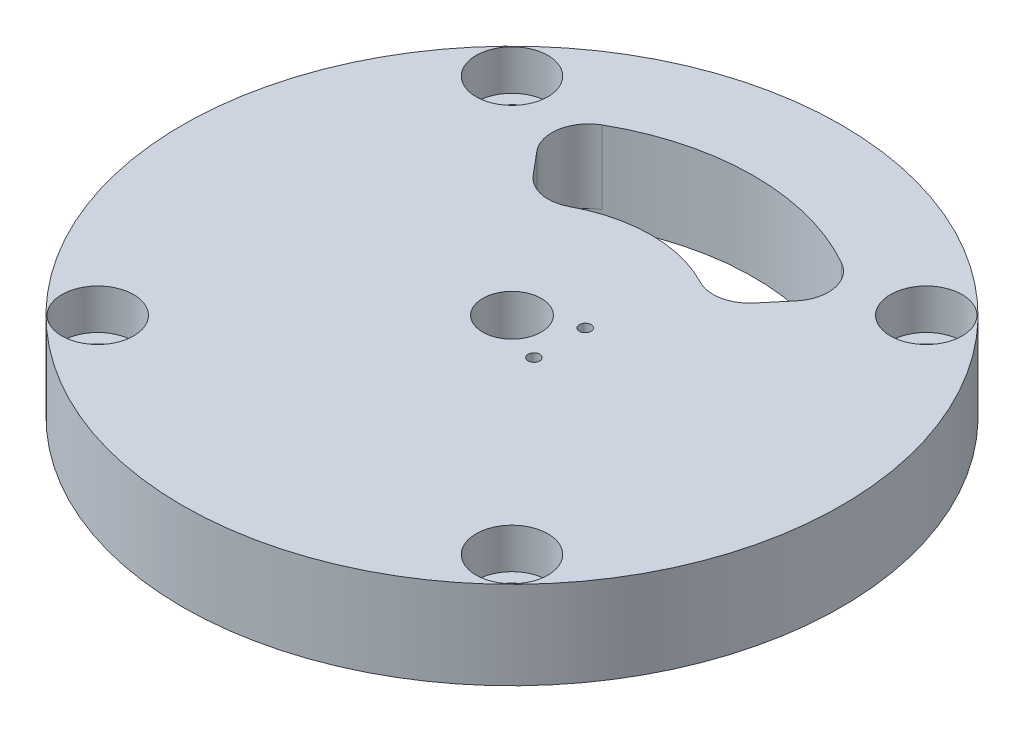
from build123d import *

# Parameters (mm, degrees)
SKETCH1_R                 = 45
SKETCH1_R_2               = 3
SKETCH1_R_3               = 4
BOSS_EXTRUDE1_DEPTH       = 12
SKETCH2_R                 = 4.9
CUT_EXTRUDE4_DEPTH        = 5.5
M2X0_4_TAPPED_HOLE1_D     = 1.6
M2X0_4_TAPPED_HOLE1_DEPTH = 5.2
M2X0_4_TAPPED_HOLE1_TIP   = 0.480688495
SKETCH4_R                 = 33
CUT_EXTRUDE5_DEPTH        = 2


with BuildPart() as part:
    # Sketch1 → Boss-Extrude1 (new body)
    with BuildSketch(Plane(origin=(0, 0, 0), x_dir=(1, 0, 0), z_dir=(0, 1, 0))):
        with Locations(Location((0, 0, 0), (0, 0, 270))):
            Circle(SKETCH1_R)
        with Locations(Location((-28.284271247, 28.284271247, 0), (0, 0, 270))):
            Circle(SKETCH1_R_2, mode=Mode.SUBTRACT)
        with Locations(Location((-28.284271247, -28.284271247, 0), (0, 0, 270))):
            Circle(SKETCH1_R_2, mode=Mode.SUBTRACT)
        with Locations(Location((28.284271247, -28.284271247, 0), (0, 0, 270))):
            Circle(SKETCH1_R_2, mode=Mode.SUBTRACT)
        with Locations(Location((28.284271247, 28.284271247, 0), (0, 0, 270))):
            Circle(SKETCH1_R_2, mode=Mode.SUBTRACT)
        with Locations(Location((0, 0, 0), (0, 0, 270))):
            Circle(SKETCH1_R_3, mode=Mode.SUBTRACT)
        with BuildLine():
            ThreePointArc((8.91272703, 16.77984794), (0, 19), (-8.91272703, 16.77984794))
            ThreePointArc((-8.91272703, 16.77984794), (-12.213284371, 16.28766723), (-15.088403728, 17.981659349))
            Line((-15.088403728, 17.981659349), (-17.708769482, 21.104489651))
            ThreePointArc((-17.708769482, 21.104489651), (-18.800399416, 25.198979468), (-16.356859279, 28.661004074))
            ThreePointArc((-16.356859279, 28.661004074), (0, 33), (16.356859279, 28.661004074))
            ThreePointArc((16.356859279, 28.661004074), (18.800399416, 25.198979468), (17.708769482, 21.104489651))
            Line((17.708769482, 21.104489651), (15.088403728, 17.981659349))
            ThreePointArc((15.088403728, 17.981659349), (12.213284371, 16.28766723), (8.91272703, 16.77984794))
        make_face(mode=Mode.SUBTRACT)
    extrude(amount=BOSS_EXTRUDE1_DEPTH)

    # Sketch2 → Cut-Extrude4 (cut)
    with BuildSketch(Plane(origin=(0, 12, 0), x_dir=(1, 0, 0), z_dir=(0, 1, 0))):
        with Locations(Location((28.284271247, 28.284271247, 0), (0, 0, 270))):
            Circle(SKETCH2_R)
        with Locations(Location((28.284271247, -28.284271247, 0), (0, 0, 270))):
            Circle(SKETCH2_R)
        with Locations(Location((-28.284271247, -28.284271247, 0), (0, 0, 270))):
            Circle(SKETCH2_R)
        with Locations(Location((-28.284271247, 28.284271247, 0), (0, 0, 270))):
            Circle(SKETCH2_R)
    extrude(amount=-CUT_EXTRUDE4_DEPTH, mode=Mode.SUBTRACT)

    # M2x0.4 Tapped Hole1
    with Locations(Plane(origin=(6.5, 12, -3.5), x_dir=(0, 0, 1), z_dir=(0, 1, 0))):
        with Locations((0, 0), (7, 0)):
            Hole(M2X0_4_TAPPED_HOLE1_D / 2, depth=M2X0_4_TAPPED_HOLE1_DEPTH)
            with Locations((0, 0, -(M2X0_4_TAPPED_HOLE1_DEPTH + M2X0_4_TAPPED_HOLE1_TIP / 2))):  # 118° drill point
                Cone(0, M2X0_4_TAPPED_HOLE1_D / 2, M2X0_4_TAPPED_HOLE1_TIP, mode=Mode.SUBTRACT)

    # Sketch4 → Cut-Extrude5 (cut)
    with BuildSketch(Plane.XZ):
        with Locations(Location((0, 0, 0), (0, 0, 299.713439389))):
            Circle(SKETCH4_R)
    extrude(amount=-CUT_EXTRUDE5_DEPTH, mode=Mode.SUBTRACT)


solid = part.part
